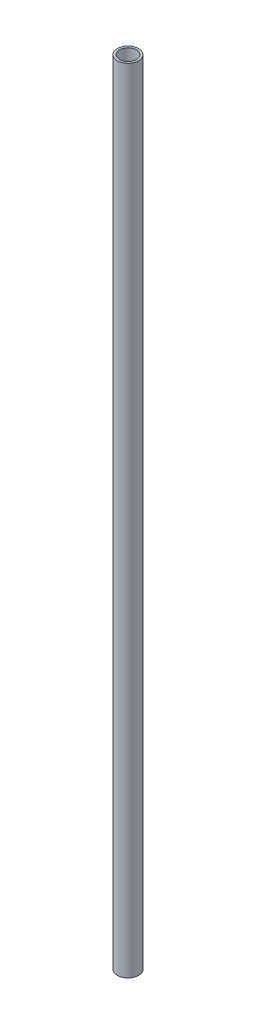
from build123d import *

# Parameters (mm, degrees)
SKETCH_1_R      = 2.5
SKETCH_1_R_2    = 2
EXTRUDE_1_DEPTH = 187


with BuildPart() as part:
    # Sketch 1 → Extrude 1 (new body)
    with BuildSketch(Plane(origin=(0, 0, 0), x_dir=(1, 0, 0), z_dir=(0, 1, 0))):
        with Locations(Location((0, 0, 0), (0, 0, 270))):
            Circle(SKETCH_1_R)
        with Locations(Location((0, 0, 0), (0, 0, 270))):
            Circle(SKETCH_1_R_2, mode=Mode.SUBTRACT)
    extrude(amount=EXTRUDE_1_DEPTH)


solid = part.part
